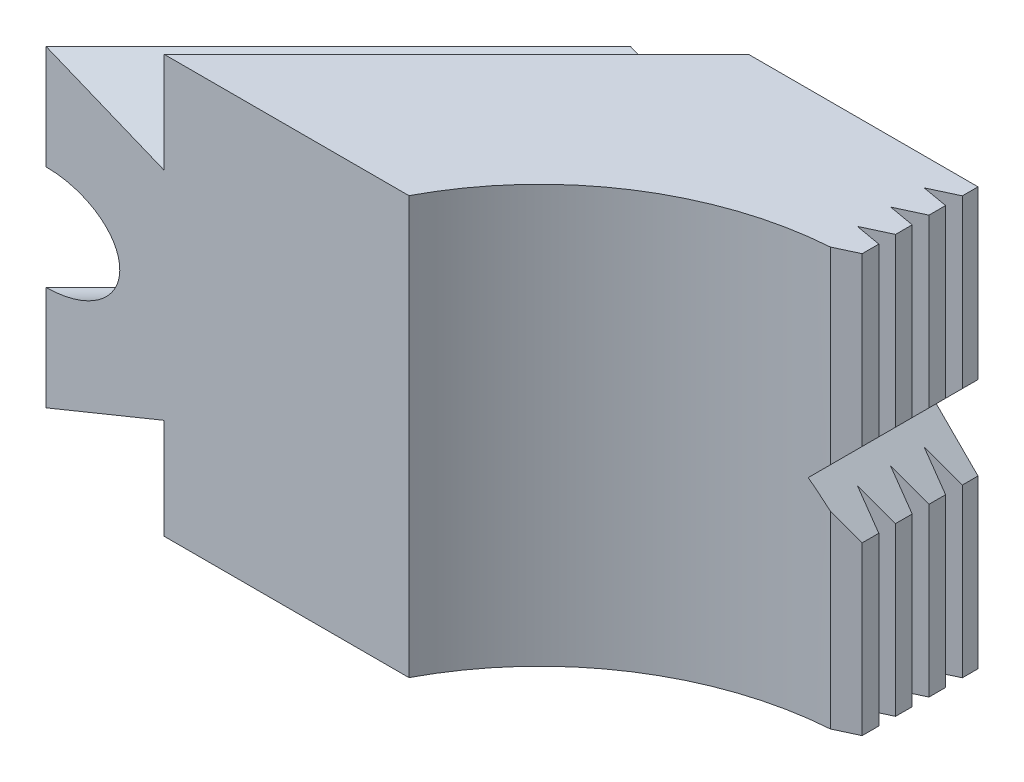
ISO-10303-21;
HEADER;
FILE_DESCRIPTION(('STEP AP214'),'2;1');
FILE_NAME('part.step','',(''),(''),'','','');
FILE_SCHEMA(('AUTOMOTIVE_DESIGN { 1 0 10303 214 1 1 1 1 }'));
ENDSEC;
DATA;
#1=APPLICATION_CONTEXT('core data for automotive mechanical design processes');
#2=APPLICATION_PROTOCOL_DEFINITION('international standard','automotive_design',2000,#1);
#3=PRODUCT_CONTEXT('',#1,'mechanical');
#4=PRODUCT('Part','Part','',(#3));
#5=PRODUCT_RELATED_PRODUCT_CATEGORY('part','',(#4));
#6=PRODUCT_DEFINITION_FORMATION('','',#4);
#7=PRODUCT_DEFINITION_CONTEXT('part definition',#1,'design');
#8=PRODUCT_DEFINITION('design','',#6,#7);
#9=PRODUCT_DEFINITION_SHAPE('','',#8);
#10=(LENGTH_UNIT() NAMED_UNIT(*) SI_UNIT(.MILLI.,.METRE.));
#11=(NAMED_UNIT(*) PLANE_ANGLE_UNIT() SI_UNIT($,.RADIAN.));
#12=(NAMED_UNIT(*) SI_UNIT($,.STERADIAN.) SOLID_ANGLE_UNIT());
#13=UNCERTAINTY_MEASURE_WITH_UNIT(LENGTH_MEASURE(1.E-05),#10,'distance_accuracy_value','');
#14=(GEOMETRIC_REPRESENTATION_CONTEXT(3) GLOBAL_UNCERTAINTY_ASSIGNED_CONTEXT((#13)) GLOBAL_UNIT_ASSIGNED_CONTEXT((#10,
#11,#12)) REPRESENTATION_CONTEXT('',''));
#15=CARTESIAN_POINT('',(0.,0.,0.));
#16=DIRECTION('',(0.,0.,1.));
#17=DIRECTION('',(1.,0.,0.));
#18=AXIS2_PLACEMENT_3D('',#15,#16,#17);
#19=CARTESIAN_POINT('',(-14.2114177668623,6.92820323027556,14.2114177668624));
#20=DIRECTION('',(0.707106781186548,0.,-0.707106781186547));
#21=DIRECTION('',(0.,1.,0.));
#22=AXIS2_PLACEMENT_3D('',#19,#20,#21);
#23=PLANE('',#22);
#24=DIRECTION('',(-0.353553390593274,-0.866025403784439,-0.353553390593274));
#25=VECTOR('',#24,1.);
#26=CARTESIAN_POINT('',(-15.6256313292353,3.4641016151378,12.7972042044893));
#27=LINE('',#26,#25);
#28=CARTESIAN_POINT('',(-15.6256313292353,3.4641016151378,12.7972042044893));
#29=VERTEX_POINT('',#28);
#30=CARTESIAN_POINT('',(-17.0398448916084,0.,11.3829906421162));
#31=VERTEX_POINT('',#30);
#32=EDGE_CURVE('E419',#29,#31,#27,.T.);
#33=ORIENTED_EDGE('',*,*,#32,.T.);
#34=DIRECTION('',(0.353553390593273,-0.866025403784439,0.353553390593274));
#35=VECTOR('',#34,1.);
#36=CARTESIAN_POINT('',(-17.0398448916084,0.,11.3829906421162));
#37=LINE('',#36,#35);
#38=CARTESIAN_POINT('',(-15.6256313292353,-3.46410161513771,12.7972042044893));
#39=VERTEX_POINT('',#38);
#40=EDGE_CURVE('E422',#31,#39,#37,.T.);
#41=ORIENTED_EDGE('',*,*,#40,.T.);
#42=DIRECTION('',(0.707106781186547,0.,0.707106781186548));
#43=VECTOR('',#42,1.);
#44=CARTESIAN_POINT('',(-15.6256313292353,-3.46410161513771,12.7972042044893));
#45=LINE('',#44,#43);
#46=CARTESIAN_POINT('',(-12.7972042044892,-3.46410161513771,15.6256313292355));
#47=VERTEX_POINT('',#46);
#48=EDGE_CURVE('E425',#39,#47,#45,.T.);
#49=ORIENTED_EDGE('',*,*,#48,.T.);
#50=DIRECTION('',(0.353553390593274,0.866025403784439,0.353553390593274));
#51=VECTOR('',#50,1.);
#52=CARTESIAN_POINT('',(-12.7972042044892,-3.46410161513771,15.6256313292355));
#53=LINE('',#52,#51);
#54=CARTESIAN_POINT('',(-11.3829906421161,0.,17.0398448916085));
#55=VERTEX_POINT('',#54);
#56=EDGE_CURVE('E428',#47,#55,#53,.T.);
#57=ORIENTED_EDGE('',*,*,#56,.T.);
#58=DIRECTION('',(-0.353553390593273,0.866025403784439,-0.353553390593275));
#59=VECTOR('',#58,1.);
#60=CARTESIAN_POINT('',(-11.3829906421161,0.,17.0398448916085));
#61=LINE('',#60,#59);
#62=CARTESIAN_POINT('',(-12.7972042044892,3.4641016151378,15.6256313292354));
#63=VERTEX_POINT('',#62);
#64=EDGE_CURVE('E431',#55,#63,#61,.T.);
#65=ORIENTED_EDGE('',*,*,#64,.T.);
#66=DIRECTION('',(-0.707106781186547,0.,-0.707106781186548));
#67=VECTOR('',#66,1.);
#68=CARTESIAN_POINT('',(-12.7972042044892,3.4641016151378,15.6256313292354));
#69=LINE('',#68,#67);
#70=EDGE_CURVE('E434',#63,#29,#69,.T.);
#71=ORIENTED_EDGE('',*,*,#70,.T.);
#72=EDGE_LOOP('',(#33,#41,#49,#57,#65,#71));
#73=FACE_BOUND('',#72,.T.);
#74=ADVANCED_FACE('F14',(#73),#23,.F.);
#75=CARTESIAN_POINT('',(-17.0398448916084,0.,11.3829906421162));
#76=DIRECTION('',(-0.612372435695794,-0.5,-0.612372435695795));
#77=DIRECTION('',(0.353553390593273,-0.866025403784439,0.353553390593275));
#78=AXIS2_PLACEMENT_3D('',#75,#76,#77);
#79=PLANE('',#78);
#80=DIRECTION('',(0.353553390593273,-0.866025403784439,0.353553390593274));
#81=VECTOR('',#80,1.);
#82=CARTESIAN_POINT('',(-22.6966991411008,0.,17.0398448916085));
#83=LINE('',#82,#81);
#84=CARTESIAN_POINT('',(-22.6966991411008,0.,17.0398448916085));
#85=VERTEX_POINT('',#84);
#86=CARTESIAN_POINT('',(-21.2824855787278,-3.4641016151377,18.4540584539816));
#87=VERTEX_POINT('',#86);
#88=EDGE_CURVE('E404',#85,#87,#83,.T.);
#89=ORIENTED_EDGE('',*,*,#88,.T.);
#90=DIRECTION('',(-0.707106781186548,0.,0.707106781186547));
#91=VECTOR('',#90,1.);
#92=CARTESIAN_POINT('',(-15.6256313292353,-3.46410161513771,12.7972042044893));
#93=LINE('',#92,#91);
#94=EDGE_CURVE('E447',#39,#87,#93,.T.);
#95=ORIENTED_EDGE('',*,*,#94,.F.);
#96=ORIENTED_EDGE('',*,*,#40,.F.);
#97=DIRECTION('',(-0.707106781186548,0.,0.707106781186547));
#98=VECTOR('',#97,1.);
#99=CARTESIAN_POINT('',(-17.0398448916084,0.,11.3829906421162));
#100=LINE('',#99,#98);
#101=EDGE_CURVE('E437',#31,#85,#100,.T.);
#102=ORIENTED_EDGE('',*,*,#101,.T.);
#103=EDGE_LOOP('',(#89,#95,#96,#102));
#104=FACE_BOUND('',#103,.T.);
#105=ADVANCED_FACE('F475',(#104),#79,.F.);
#106=CARTESIAN_POINT('',(-15.6256313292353,-3.46410161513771,12.7972042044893));
#107=DIRECTION('',(0.,-1.,0.));
#108=DIRECTION('',(0.707106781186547,0.,0.707106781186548));
#109=AXIS2_PLACEMENT_3D('',#106,#107,#108);
#110=PLANE('',#109);
#111=DIRECTION('',(0.707106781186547,0.,0.707106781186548));
#112=VECTOR('',#111,1.);
#113=CARTESIAN_POINT('',(-21.2824855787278,-3.4641016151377,18.4540584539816));
#114=LINE('',#113,#112);
#115=CARTESIAN_POINT('',(-18.4540584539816,-3.4641016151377,21.2824855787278));
#116=VERTEX_POINT('',#115);
#117=EDGE_CURVE('E407',#87,#116,#114,.T.);
#118=ORIENTED_EDGE('',*,*,#117,.T.);
#119=DIRECTION('',(-0.707106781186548,0.,0.707106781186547));
#120=VECTOR('',#119,1.);
#121=CARTESIAN_POINT('',(-12.7972042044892,-3.46410161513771,15.6256313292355));
#122=LINE('',#121,#120);
#123=EDGE_CURVE('E445',#47,#116,#122,.T.);
#124=ORIENTED_EDGE('',*,*,#123,.F.);
#125=ORIENTED_EDGE('',*,*,#48,.F.);
#126=ORIENTED_EDGE('',*,*,#94,.T.);
#127=EDGE_LOOP('',(#118,#124,#125,#126));
#128=FACE_BOUND('',#127,.T.);
#129=ADVANCED_FACE('F481',(#128),#110,.F.);
#130=CARTESIAN_POINT('',(-12.7972042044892,-3.46410161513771,15.6256313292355));
#131=DIRECTION('',(0.612372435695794,-0.5,0.612372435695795));
#132=DIRECTION('',(0.353553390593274,0.866025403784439,0.353553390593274));
#133=AXIS2_PLACEMENT_3D('',#130,#131,#132);
#134=PLANE('',#133);
#135=DIRECTION('',(0.353553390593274,0.866025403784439,0.353553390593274));
#136=VECTOR('',#135,1.);
#137=CARTESIAN_POINT('',(-18.4540584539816,-3.4641016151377,21.2824855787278));
#138=LINE('',#137,#136);
#139=CARTESIAN_POINT('',(-17.0398448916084,0.,22.6966991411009));
#140=VERTEX_POINT('',#139);
#141=EDGE_CURVE('E410',#116,#140,#138,.T.);
#142=ORIENTED_EDGE('',*,*,#141,.T.);
#143=DIRECTION('',(-0.707106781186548,0.,0.707106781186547));
#144=VECTOR('',#143,1.);
#145=CARTESIAN_POINT('',(-11.3829906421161,0.,17.0398448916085));
#146=LINE('',#145,#144);
#147=EDGE_CURVE('E443',#55,#140,#146,.T.);
#148=ORIENTED_EDGE('',*,*,#147,.F.);
#149=ORIENTED_EDGE('',*,*,#56,.F.);
#150=ORIENTED_EDGE('',*,*,#123,.T.);
#151=EDGE_LOOP('',(#142,#148,#149,#150));
#152=FACE_BOUND('',#151,.T.);
#153=ADVANCED_FACE('F494',(#152),#134,.F.);
#154=CARTESIAN_POINT('',(-11.3829906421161,0.,17.0398448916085));
#155=DIRECTION('',(0.612372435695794,0.5,0.612372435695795));
#156=DIRECTION('',(-0.353553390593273,0.866025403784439,-0.353553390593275));
#157=AXIS2_PLACEMENT_3D('',#154,#155,#156);
#158=PLANE('',#157);
#159=DIRECTION('',(-0.353553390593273,0.866025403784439,-0.353553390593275));
#160=VECTOR('',#159,1.);
#161=CARTESIAN_POINT('',(-17.0398448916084,0.,22.6966991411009));
#162=LINE('',#161,#160);
#163=CARTESIAN_POINT('',(-18.4540584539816,3.46410161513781,21.2824855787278));
#164=VERTEX_POINT('',#163);
#165=EDGE_CURVE('E413',#140,#164,#162,.T.);
#166=ORIENTED_EDGE('',*,*,#165,.T.);
#167=DIRECTION('',(-0.707106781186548,0.,0.707106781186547));
#168=VECTOR('',#167,1.);
#169=CARTESIAN_POINT('',(-12.7972042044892,3.4641016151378,15.6256313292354));
#170=LINE('',#169,#168);
#171=EDGE_CURVE('E441',#63,#164,#170,.T.);
#172=ORIENTED_EDGE('',*,*,#171,.F.);
#173=ORIENTED_EDGE('',*,*,#64,.F.);
#174=ORIENTED_EDGE('',*,*,#147,.T.);
#175=EDGE_LOOP('',(#166,#172,#173,#174));
#176=FACE_BOUND('',#175,.T.);
#177=ADVANCED_FACE('F490',(#176),#158,.F.);
#178=CARTESIAN_POINT('',(-12.7972042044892,3.4641016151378,15.6256313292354));
#179=DIRECTION('',(0.,1.,0.));
#180=DIRECTION('',(-0.707106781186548,0.,0.707106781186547));
#181=AXIS2_PLACEMENT_3D('',#178,#179,#180);
#182=PLANE('',#181);
#183=DIRECTION('',(-0.707106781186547,0.,-0.707106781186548));
#184=VECTOR('',#183,1.);
#185=CARTESIAN_POINT('',(-18.4540584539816,3.46410161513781,21.2824855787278));
#186=LINE('',#185,#184);
#187=CARTESIAN_POINT('',(-21.2824855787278,3.46410161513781,18.4540584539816));
#188=VERTEX_POINT('',#187);
#189=EDGE_CURVE('E416',#164,#188,#186,.T.);
#190=ORIENTED_EDGE('',*,*,#189,.T.);
#191=DIRECTION('',(-0.707106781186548,0.,0.707106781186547));
#192=VECTOR('',#191,1.);
#193=CARTESIAN_POINT('',(-15.6256313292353,3.4641016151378,12.7972042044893));
#194=LINE('',#193,#192);
#195=EDGE_CURVE('E438',#29,#188,#194,.T.);
#196=ORIENTED_EDGE('',*,*,#195,.F.);
#197=ORIENTED_EDGE('',*,*,#70,.F.);
#198=ORIENTED_EDGE('',*,*,#171,.T.);
#199=EDGE_LOOP('',(#190,#196,#197,#198));
#200=FACE_BOUND('',#199,.T.);
#201=ADVANCED_FACE('F471',(#200),#182,.F.);
#202=CARTESIAN_POINT('',(-15.6256313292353,3.4641016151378,12.7972042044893));
#203=DIRECTION('',(-0.612372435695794,0.5,-0.612372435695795));
#204=DIRECTION('',(-0.353553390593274,-0.866025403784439,-0.353553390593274));
#205=AXIS2_PLACEMENT_3D('',#202,#203,#204);
#206=PLANE('',#205);
#207=DIRECTION('',(-0.353553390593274,-0.866025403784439,-0.353553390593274));
#208=VECTOR('',#207,1.);
#209=CARTESIAN_POINT('',(-21.2824855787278,3.46410161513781,18.4540584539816));
#210=LINE('',#209,#208);
#211=EDGE_CURVE('E402',#188,#85,#210,.T.);
#212=ORIENTED_EDGE('',*,*,#211,.T.);
#213=ORIENTED_EDGE('',*,*,#101,.F.);
#214=ORIENTED_EDGE('',*,*,#32,.F.);
#215=ORIENTED_EDGE('',*,*,#195,.T.);
#216=EDGE_LOOP('',(#212,#213,#214,#215));
#217=FACE_BOUND('',#216,.T.);
#218=ADVANCED_FACE('F464',(#217),#206,.F.);
#219=CARTESIAN_POINT('',(-5.72613639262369,0.,5.72613639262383));
#220=DIRECTION('',(-0.707106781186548,0.,0.707106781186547));
#221=DIRECTION('',(0.,-1.,0.));
#222=AXIS2_PLACEMENT_3D('',#219,#220,#221);
#223=PLANE('',#222);
#224=CARTESIAN_POINT('',(-5.72613639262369,0.,5.72613639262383));
#225=DIRECTION('',(-0.707106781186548,0.,0.707106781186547));
#226=DIRECTION('',(0.,-1.,0.));
#227=AXIS2_PLACEMENT_3D('',#224,#225,#226);
#228=CIRCLE('',#227,9.);
#229=CARTESIAN_POINT('',(-5.72613639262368,9.,5.72613639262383));
#230=VERTEX_POINT('',#229);
#231=CARTESIAN_POINT('',(-5.7261363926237,-9.,5.72613639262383));
#232=VERTEX_POINT('',#231);
#233=EDGE_CURVE('E440',#230,#232,#228,.T.);
#234=ORIENTED_EDGE('',*,*,#233,.F.);
#235=DIRECTION('',(0.,-1.,0.));
#236=VECTOR('',#235,1.);
#237=CARTESIAN_POINT('',(-5.72613639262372,-20.,5.72613639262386));
#238=LINE('',#237,#236);
#239=EDGE_CURVE('E377',#230,#232,#238,.T.);
#240=ORIENTED_EDGE('',*,*,#239,.T.);
#241=EDGE_LOOP('',(#234,#240));
#242=FACE_BOUND('',#241,.T.);
#243=ADVANCED_FACE('F462',(#242),#223,.F.);
#244=CARTESIAN_POINT('',(-19.8682720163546,0.,19.8682720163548));
#245=DIRECTION('',(-0.707106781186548,0.,0.707106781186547));
#246=DIRECTION('',(0.,-1.,0.));
#247=AXIS2_PLACEMENT_3D('',#244,#245,#246);
#248=PLANE('',#247);
#249=DIRECTION('',(0.,-1.,0.));
#250=VECTOR('',#249,1.);
#251=CARTESIAN_POINT('',(-19.8682720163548,-20.,19.8682720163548));
#252=LINE('',#251,#250);
#253=CARTESIAN_POINT('',(-19.8682720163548,-5.,19.8682720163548));
#254=VERTEX_POINT('',#253);
#255=CARTESIAN_POINT('',(-19.8682720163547,-9.,19.8682720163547));
#256=VERTEX_POINT('',#255);
#257=EDGE_CURVE('E31',#254,#256,#252,.T.);
#258=ORIENTED_EDGE('',*,*,#257,.F.);
#259=CARTESIAN_POINT('',(-19.8682720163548,0.,19.8682720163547));
#260=DIRECTION('',(-0.707106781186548,0.,0.707106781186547));
#261=DIRECTION('',(0.707106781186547,0.,0.707106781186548));
#262=AXIS2_PLACEMENT_3D('',#259,#260,#261);
#263=CIRCLE('',#262,5.);
#264=CARTESIAN_POINT('',(-19.8682720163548,5.,19.8682720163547));
#265=VERTEX_POINT('',#264);
#266=EDGE_CURVE('E351',#254,#265,#263,.T.);
#267=ORIENTED_EDGE('',*,*,#266,.T.);
#268=CARTESIAN_POINT('',(-19.8682720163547,9.,19.8682720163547));
#269=VERTEX_POINT('',#268);
#270=EDGE_CURVE('E39',#269,#265,#252,.T.);
#271=ORIENTED_EDGE('',*,*,#270,.F.);
#272=CARTESIAN_POINT('',(-19.8682720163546,0.,19.8682720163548));
#273=DIRECTION('',(-0.707106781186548,0.,0.707106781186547));
#274=DIRECTION('',(0.,-1.,0.));
#275=AXIS2_PLACEMENT_3D('',#272,#273,#274);
#276=CIRCLE('',#275,9.);
#277=EDGE_CURVE('E18',#269,#256,#276,.T.);
#278=ORIENTED_EDGE('',*,*,#277,.T.);
#279=EDGE_LOOP('',(#258,#267,#271,#278));
#280=FACE_BOUND('',#279,.T.);
#281=ORIENTED_EDGE('',*,*,#211,.F.);
#282=ORIENTED_EDGE('',*,*,#189,.F.);
#283=ORIENTED_EDGE('',*,*,#165,.F.);
#284=ORIENTED_EDGE('',*,*,#141,.F.);
#285=ORIENTED_EDGE('',*,*,#117,.F.);
#286=ORIENTED_EDGE('',*,*,#88,.F.);
#287=EDGE_LOOP('',(#281,#282,#283,#284,#285,#286));
#288=FACE_BOUND('',#287,.T.);
#289=ADVANCED_FACE('F455',(#280,#288),#248,.T.);
#290=CARTESIAN_POINT('',(-19.8682720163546,0.,19.8682720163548));
#291=DIRECTION('',(0.707106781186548,0.,-0.707106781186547));
#292=DIRECTION('',(0.,1.,0.));
#293=AXIS2_PLACEMENT_3D('',#290,#291,#292);
#294=CYLINDRICAL_SURFACE('',#293,9.);
#295=DIRECTION('',(-0.707106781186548,0.,0.707106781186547));
#296=VECTOR('',#295,1.);
#297=CARTESIAN_POINT('',(-5.72613639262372,-9.,5.72613639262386));
#298=LINE('',#297,#296);
#299=EDGE_CURVE('E9',#256,#232,#298,.F.);
#300=ORIENTED_EDGE('',*,*,#299,.F.);
#301=ORIENTED_EDGE('',*,*,#277,.F.);
#302=DIRECTION('',(-0.707106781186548,0.,0.707106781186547));
#303=VECTOR('',#302,1.);
#304=CARTESIAN_POINT('',(-5.72613639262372,9.,5.72613639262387));
#305=LINE('',#304,#303);
#306=EDGE_CURVE('E23',#230,#269,#305,.T.);
#307=ORIENTED_EDGE('',*,*,#306,.F.);
#308=ORIENTED_EDGE('',*,*,#233,.T.);
#309=EDGE_LOOP('',(#300,#301,#307,#308));
#310=FACE_BOUND('',#309,.T.);
#311=ADVANCED_FACE('F16',(#310),#294,.T.);
#312=CARTESIAN_POINT('',(33.3137084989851,-20.,1.49999999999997));
#313=DIRECTION('',(-0.422618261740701,0.,-0.906307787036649));
#314=DIRECTION('',(-0.906307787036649,0.,0.422618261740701));
#315=AXIS2_PLACEMENT_3D('',#312,#313,#314);
#316=PLANE('',#315);
#317=DIRECTION('',(0.,1.,0.));
#318=VECTOR('',#317,1.);
#319=CARTESIAN_POINT('',(30.8137084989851,-20.,2.66576914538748));
#320=LINE('',#319,#318);
#321=CARTESIAN_POINT('',(30.8137084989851,1.49999999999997,2.66576914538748));
#322=VERTEX_POINT('',#321);
#323=CARTESIAN_POINT('',(30.8137084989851,20.,2.66576914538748));
#324=VERTEX_POINT('',#323);
#325=EDGE_CURVE('E939',#322,#324,#320,.T.);
#326=ORIENTED_EDGE('',*,*,#325,.F.);
#327=DIRECTION('',(0.671542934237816,0.671542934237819,-0.313145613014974));
#328=VECTOR('',#327,1.);
#329=CARTESIAN_POINT('',(22.490430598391,-6.82327790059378,6.5469773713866));
#330=LINE('',#329,#328);
#331=CARTESIAN_POINT('',(33.3137084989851,4.,1.49999999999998));
#332=VERTEX_POINT('',#331);
#333=EDGE_CURVE('E1033',#322,#332,#330,.T.);
#334=ORIENTED_EDGE('',*,*,#333,.T.);
#335=DIRECTION('',(0.,1.,0.));
#336=VECTOR('',#335,1.);
#337=CARTESIAN_POINT('',(33.3137084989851,-20.,1.49999999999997));
#338=LINE('',#337,#336);
#339=CARTESIAN_POINT('',(33.3137084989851,20.,1.49999999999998));
#340=VERTEX_POINT('',#339);
#341=EDGE_CURVE('E940',#332,#340,#338,.T.);
#342=ORIENTED_EDGE('',*,*,#341,.T.);
#343=DIRECTION('',(-0.906307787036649,0.,0.422618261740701));
#344=VECTOR('',#343,1.);
#345=CARTESIAN_POINT('',(33.3137084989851,20.,1.49999999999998));
#346=LINE('',#345,#344);
#347=EDGE_CURVE('E920',#340,#324,#346,.T.);
#348=ORIENTED_EDGE('',*,*,#347,.T.);
#349=EDGE_LOOP('',(#326,#334,#342,#348));
#350=FACE_BOUND('',#349,.T.);
#351=ADVANCED_FACE('F563',(#350),#316,.F.);
#352=CARTESIAN_POINT('',(30.8137084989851,-20.,2.66576914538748));
#353=DIRECTION('',(-0.173648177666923,0.,0.984807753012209));
#354=DIRECTION('',(0.984807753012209,0.,0.173648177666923));
#355=AXIS2_PLACEMENT_3D('',#352,#353,#354);
#356=PLANE('',#355);
#357=DIRECTION('',(0.,1.,0.));
#358=VECTOR('',#357,1.);
#359=CARTESIAN_POINT('',(33.3137084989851,-20.,3.10658659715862));
#360=LINE('',#359,#358);
#361=CARTESIAN_POINT('',(33.3137084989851,4.,3.10658659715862));
#362=VERTEX_POINT('',#361);
#363=CARTESIAN_POINT('',(33.3137084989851,20.,3.10658659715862));
#364=VERTEX_POINT('',#363);
#365=EDGE_CURVE('E934',#362,#364,#360,.T.);
#366=ORIENTED_EDGE('',*,*,#365,.F.);
#367=DIRECTION('',(-0.701673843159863,-0.701673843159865,-0.123724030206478));
#368=VECTOR('',#367,1.);
#369=CARTESIAN_POINT('',(20.228265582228,-9.08544291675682,0.799269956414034));
#370=LINE('',#369,#368);
#371=EDGE_CURVE('E1030',#362,#322,#370,.T.);
#372=ORIENTED_EDGE('',*,*,#371,.T.);
#373=ORIENTED_EDGE('',*,*,#325,.T.);
#374=DIRECTION('',(0.984807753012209,0.,0.173648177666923));
#375=VECTOR('',#374,1.);
#376=CARTESIAN_POINT('',(30.8137084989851,20.,2.66576914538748));
#377=LINE('',#376,#375);
#378=EDGE_CURVE('E950',#324,#364,#377,.T.);
#379=ORIENTED_EDGE('',*,*,#378,.T.);
#380=EDGE_LOOP('',(#366,#372,#373,#379));
#381=FACE_BOUND('',#380,.T.);
#382=ADVANCED_FACE('F572',(#381),#356,.F.);
#383=CARTESIAN_POINT('',(33.3137084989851,-20.,12.));
#384=DIRECTION('',(-1.,0.,0.));
#385=DIRECTION('',(0.,-1.,0.));
#386=AXIS2_PLACEMENT_3D('',#383,#384,#385);
#387=PLANE('',#386);
#388=DIRECTION('',(0.,1.,0.));
#389=VECTOR('',#388,1.);
#390=CARTESIAN_POINT('',(33.3137084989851,-20.,4.7));
#391=LINE('',#390,#389);
#392=CARTESIAN_POINT('',(33.3137084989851,4.,4.7));
#393=VERTEX_POINT('',#392);
#394=CARTESIAN_POINT('',(33.3137084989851,20.,4.7));
#395=VERTEX_POINT('',#394);
#396=EDGE_CURVE('E959',#393,#395,#391,.T.);
#397=ORIENTED_EDGE('',*,*,#396,.F.);
#398=DIRECTION('',(0.,0.,1.));
#399=VECTOR('',#398,1.);
#400=CARTESIAN_POINT('',(33.3137084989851,4.,0.));
#401=LINE('',#400,#399);
#402=EDGE_CURVE('E1053',#362,#393,#401,.T.);
#403=ORIENTED_EDGE('',*,*,#402,.F.);
#404=ORIENTED_EDGE('',*,*,#365,.T.);
#405=DIRECTION('',(0.,0.,1.));
#406=VECTOR('',#405,1.);
#407=CARTESIAN_POINT('',(33.3137084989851,20.,12.));
#408=LINE('',#407,#406);
#409=EDGE_CURVE('E921',#364,#395,#408,.T.);
#410=ORIENTED_EDGE('',*,*,#409,.T.);
#411=EDGE_LOOP('',(#397,#403,#404,#410));
#412=FACE_BOUND('',#411,.T.);
#413=ADVANCED_FACE('F584',(#412),#387,.F.);
#414=CARTESIAN_POINT('',(33.3137084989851,-20.,4.7));
#415=DIRECTION('',(-0.422618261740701,0.,-0.906307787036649));
#416=DIRECTION('',(-0.906307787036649,0.,0.422618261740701));
#417=AXIS2_PLACEMENT_3D('',#414,#415,#416);
#418=PLANE('',#417);
#419=DIRECTION('',(0.,1.,0.));
#420=VECTOR('',#419,1.);
#421=CARTESIAN_POINT('',(30.8137084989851,-20.,5.86576914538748));
#422=LINE('',#421,#420);
#423=CARTESIAN_POINT('',(30.8137084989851,1.49999999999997,5.86576914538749));
#424=VERTEX_POINT('',#423);
#425=CARTESIAN_POINT('',(30.8137084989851,20.,5.86576914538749));
#426=VERTEX_POINT('',#425);
#427=EDGE_CURVE('E958',#424,#426,#422,.T.);
#428=ORIENTED_EDGE('',*,*,#427,.F.);
#429=DIRECTION('',(0.671542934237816,0.671542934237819,-0.313145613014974));
#430=VECTOR('',#429,1.);
#431=CARTESIAN_POINT('',(22.490430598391,-6.82327790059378,9.7469773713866));
#432=LINE('',#431,#430);
#433=EDGE_CURVE('E1039',#424,#393,#432,.T.);
#434=ORIENTED_EDGE('',*,*,#433,.T.);
#435=ORIENTED_EDGE('',*,*,#396,.T.);
#436=DIRECTION('',(-0.906307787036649,0.,0.422618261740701));
#437=VECTOR('',#436,1.);
#438=CARTESIAN_POINT('',(33.3137084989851,20.,4.7));
#439=LINE('',#438,#437);
#440=EDGE_CURVE('E975',#395,#426,#439,.T.);
#441=ORIENTED_EDGE('',*,*,#440,.T.);
#442=EDGE_LOOP('',(#428,#434,#435,#441));
#443=FACE_BOUND('',#442,.T.);
#444=ADVANCED_FACE('F596',(#443),#418,.F.);
#445=CARTESIAN_POINT('',(30.8137084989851,-20.,5.86576914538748));
#446=DIRECTION('',(-0.173648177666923,0.,0.984807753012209));
#447=DIRECTION('',(0.984807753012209,0.,0.173648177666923));
#448=AXIS2_PLACEMENT_3D('',#445,#446,#447);
#449=PLANE('',#448);
#450=DIRECTION('',(0.,1.,0.));
#451=VECTOR('',#450,1.);
#452=CARTESIAN_POINT('',(33.3137084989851,-20.,6.30658659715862));
#453=LINE('',#452,#451);
#454=CARTESIAN_POINT('',(33.3137084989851,4.,6.30658659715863));
#455=VERTEX_POINT('',#454);
#456=CARTESIAN_POINT('',(33.3137084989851,20.,6.30658659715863));
#457=VERTEX_POINT('',#456);
#458=EDGE_CURVE('E963',#455,#457,#453,.T.);
#459=ORIENTED_EDGE('',*,*,#458,.F.);
#460=DIRECTION('',(-0.701673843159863,-0.701673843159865,-0.123724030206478));
#461=VECTOR('',#460,1.);
#462=CARTESIAN_POINT('',(20.228265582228,-9.08544291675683,3.99926995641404));
#463=LINE('',#462,#461);
#464=EDGE_CURVE('E1036',#455,#424,#463,.T.);
#465=ORIENTED_EDGE('',*,*,#464,.T.);
#466=ORIENTED_EDGE('',*,*,#427,.T.);
#467=DIRECTION('',(0.984807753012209,0.,0.173648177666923));
#468=VECTOR('',#467,1.);
#469=CARTESIAN_POINT('',(30.8137084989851,20.,5.86576914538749));
#470=LINE('',#469,#468);
#471=EDGE_CURVE('E972',#426,#457,#470,.T.);
#472=ORIENTED_EDGE('',*,*,#471,.T.);
#473=EDGE_LOOP('',(#459,#465,#466,#472));
#474=FACE_BOUND('',#473,.T.);
#475=ADVANCED_FACE('F576',(#474),#449,.F.);
#476=DIRECTION('',(0.,1.,0.));
#477=VECTOR('',#476,1.);
#478=CARTESIAN_POINT('',(33.3137084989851,-20.,7.9));
#479=LINE('',#478,#477);
#480=CARTESIAN_POINT('',(33.3137084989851,4.,7.9));
#481=VERTEX_POINT('',#480);
#482=CARTESIAN_POINT('',(33.3137084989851,20.,7.9));
#483=VERTEX_POINT('',#482);
#484=EDGE_CURVE('E983',#481,#483,#479,.T.);
#485=ORIENTED_EDGE('',*,*,#484,.F.);
#486=EDGE_CURVE('E1074',#455,#481,#401,.T.);
#487=ORIENTED_EDGE('',*,*,#486,.F.);
#488=ORIENTED_EDGE('',*,*,#458,.T.);
#489=EDGE_CURVE('E926',#457,#483,#408,.T.);
#490=ORIENTED_EDGE('',*,*,#489,.T.);
#491=EDGE_LOOP('',(#485,#487,#488,#490));
#492=FACE_BOUND('',#491,.T.);
#493=ADVANCED_FACE('F599',(#492),#387,.F.);
#494=CARTESIAN_POINT('',(33.3137084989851,-20.,7.9));
#495=DIRECTION('',(-0.422618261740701,0.,-0.906307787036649));
#496=DIRECTION('',(-0.906307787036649,0.,0.422618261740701));
#497=AXIS2_PLACEMENT_3D('',#494,#495,#496);
#498=PLANE('',#497);
#499=DIRECTION('',(0.,1.,0.));
#500=VECTOR('',#499,1.);
#501=CARTESIAN_POINT('',(30.8137084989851,-20.,9.06576914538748));
#502=LINE('',#501,#500);
#503=CARTESIAN_POINT('',(30.8137084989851,1.49999999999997,9.06576914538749));
#504=VERTEX_POINT('',#503);
#505=CARTESIAN_POINT('',(30.8137084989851,20.,9.06576914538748));
#506=VERTEX_POINT('',#505);
#507=EDGE_CURVE('E982',#504,#506,#502,.T.);
#508=ORIENTED_EDGE('',*,*,#507,.F.);
#509=DIRECTION('',(0.671542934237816,0.671542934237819,-0.313145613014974));
#510=VECTOR('',#509,1.);
#511=CARTESIAN_POINT('',(22.490430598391,-6.82327790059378,12.9469773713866));
#512=LINE('',#511,#510);
#513=EDGE_CURVE('E1045',#504,#481,#512,.T.);
#514=ORIENTED_EDGE('',*,*,#513,.T.);
#515=ORIENTED_EDGE('',*,*,#484,.T.);
#516=DIRECTION('',(-0.906307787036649,0.,0.422618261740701));
#517=VECTOR('',#516,1.);
#518=CARTESIAN_POINT('',(33.3137084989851,20.,7.9));
#519=LINE('',#518,#517);
#520=EDGE_CURVE('E999',#483,#506,#519,.T.);
#521=ORIENTED_EDGE('',*,*,#520,.T.);
#522=EDGE_LOOP('',(#508,#514,#515,#521));
#523=FACE_BOUND('',#522,.T.);
#524=ADVANCED_FACE('F628',(#523),#498,.F.);
#525=CARTESIAN_POINT('',(30.8137084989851,-20.,9.06576914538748));
#526=DIRECTION('',(-0.173648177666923,0.,0.984807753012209));
#527=DIRECTION('',(0.984807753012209,0.,0.173648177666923));
#528=AXIS2_PLACEMENT_3D('',#525,#526,#527);
#529=PLANE('',#528);
#530=DIRECTION('',(0.,1.,0.));
#531=VECTOR('',#530,1.);
#532=CARTESIAN_POINT('',(33.3137084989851,-20.,9.50658659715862));
#533=LINE('',#532,#531);
#534=CARTESIAN_POINT('',(33.3137084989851,4.,9.50658659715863));
#535=VERTEX_POINT('',#534);
#536=CARTESIAN_POINT('',(33.3137084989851,20.,9.50658659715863));
#537=VERTEX_POINT('',#536);
#538=EDGE_CURVE('E987',#535,#537,#533,.T.);
#539=ORIENTED_EDGE('',*,*,#538,.F.);
#540=DIRECTION('',(-0.701673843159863,-0.701673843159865,-0.123724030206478));
#541=VECTOR('',#540,1.);
#542=CARTESIAN_POINT('',(20.228265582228,-9.08544291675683,7.19926995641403));
#543=LINE('',#542,#541);
#544=EDGE_CURVE('E1042',#535,#504,#543,.T.);
#545=ORIENTED_EDGE('',*,*,#544,.T.);
#546=ORIENTED_EDGE('',*,*,#507,.T.);
#547=DIRECTION('',(0.984807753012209,0.,0.173648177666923));
#548=VECTOR('',#547,1.);
#549=CARTESIAN_POINT('',(30.8137084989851,20.,9.06576914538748));
#550=LINE('',#549,#548);
#551=EDGE_CURVE('E996',#506,#537,#550,.T.);
#552=ORIENTED_EDGE('',*,*,#551,.T.);
#553=EDGE_LOOP('',(#539,#545,#546,#552));
#554=FACE_BOUND('',#553,.T.);
#555=ADVANCED_FACE('F610',(#554),#529,.F.);
#556=DIRECTION('',(0.,1.,0.));
#557=VECTOR('',#556,1.);
#558=CARTESIAN_POINT('',(33.3137084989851,-20.,11.1));
#559=LINE('',#558,#557);
#560=CARTESIAN_POINT('',(33.3137084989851,4.,11.1));
#561=VERTEX_POINT('',#560);
#562=CARTESIAN_POINT('',(33.3137084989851,20.,11.1));
#563=VERTEX_POINT('',#562);
#564=EDGE_CURVE('E1005',#561,#563,#559,.T.);
#565=ORIENTED_EDGE('',*,*,#564,.F.);
#566=EDGE_CURVE('E297',#535,#561,#401,.T.);
#567=ORIENTED_EDGE('',*,*,#566,.F.);
#568=ORIENTED_EDGE('',*,*,#538,.T.);
#569=EDGE_CURVE('E923',#537,#563,#408,.T.);
#570=ORIENTED_EDGE('',*,*,#569,.T.);
#571=EDGE_LOOP('',(#565,#567,#568,#570));
#572=FACE_BOUND('',#571,.T.);
#573=ADVANCED_FACE('F630',(#572),#387,.F.);
#574=CARTESIAN_POINT('',(33.3137084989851,-20.,11.1));
#575=DIRECTION('',(-0.422618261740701,0.,-0.906307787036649));
#576=DIRECTION('',(-0.906307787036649,0.,0.422618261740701));
#577=AXIS2_PLACEMENT_3D('',#574,#575,#576);
#578=PLANE('',#577);
#579=DIRECTION('',(0.,1.,0.));
#580=VECTOR('',#579,1.);
#581=CARTESIAN_POINT('',(31.2279773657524,-20.,12.0725924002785));
#582=LINE('',#581,#580);
#583=CARTESIAN_POINT('',(31.2279773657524,1.91426886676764,12.0725924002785));
#584=VERTEX_POINT('',#583);
#585=CARTESIAN_POINT('',(31.2279773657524,20.,12.0725924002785));
#586=VERTEX_POINT('',#585);
#587=EDGE_CURVE('E392',#584,#586,#582,.T.);
#588=ORIENTED_EDGE('',*,*,#587,.F.);
#589=DIRECTION('',(0.671542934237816,0.671542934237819,-0.313145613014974));
#590=VECTOR('',#589,1.);
#591=CARTESIAN_POINT('',(22.490430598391,-6.82327790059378,16.1469773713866));
#592=LINE('',#591,#590);
#593=EDGE_CURVE('E396',#584,#561,#592,.T.);
#594=ORIENTED_EDGE('',*,*,#593,.T.);
#595=ORIENTED_EDGE('',*,*,#564,.T.);
#596=DIRECTION('',(-0.906307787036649,0.,0.422618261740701));
#597=VECTOR('',#596,1.);
#598=CARTESIAN_POINT('',(33.3137084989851,20.,11.1));
#599=LINE('',#598,#597);
#600=EDGE_CURVE('E1008',#563,#586,#599,.T.);
#601=ORIENTED_EDGE('',*,*,#600,.T.);
#602=EDGE_LOOP('',(#588,#594,#595,#601));
#603=FACE_BOUND('',#602,.T.);
#604=ADVANCED_FACE('F641',(#603),#578,.F.);
#605=CARTESIAN_POINT('',(30.8137084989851,-20.,9.06576914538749));
#606=VERTEX_POINT('',#605);
#607=CARTESIAN_POINT('',(30.8137084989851,-1.49999999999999,9.06576914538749));
#608=VERTEX_POINT('',#607);
#609=EDGE_CURVE('E984',#606,#608,#502,.T.);
#610=ORIENTED_EDGE('',*,*,#609,.T.);
#611=DIRECTION('',(0.701673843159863,-0.701673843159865,0.123724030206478));
#612=VECTOR('',#611,1.);
#613=CARTESIAN_POINT('',(39.9221128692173,-10.6084043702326,10.6718265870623));
#614=LINE('',#613,#612);
#615=CARTESIAN_POINT('',(33.3137084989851,-4.,9.50658659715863));
#616=VERTEX_POINT('',#615);
#617=EDGE_CURVE('E1021',#608,#616,#614,.T.);
#618=ORIENTED_EDGE('',*,*,#617,.T.);
#619=CARTESIAN_POINT('',(33.3137084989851,-20.,9.50658659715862));
#620=VERTEX_POINT('',#619);
#621=EDGE_CURVE('E978',#620,#616,#533,.T.);
#622=ORIENTED_EDGE('',*,*,#621,.F.);
#623=DIRECTION('',(0.984807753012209,0.,0.173648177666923));
#624=VECTOR('',#623,1.);
#625=CARTESIAN_POINT('',(30.8137084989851,-20.,9.06576914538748));
#626=LINE('',#625,#624);
#627=EDGE_CURVE('E990',#606,#620,#626,.T.);
#628=ORIENTED_EDGE('',*,*,#627,.F.);
#629=EDGE_LOOP('',(#610,#618,#622,#628));
#630=FACE_BOUND('',#629,.T.);
#631=ADVANCED_FACE('F651',(#630),#529,.F.);
#632=CARTESIAN_POINT('',(33.3137084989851,-20.,7.9));
#633=VERTEX_POINT('',#632);
#634=CARTESIAN_POINT('',(33.3137084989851,-4.,7.9));
#635=VERTEX_POINT('',#634);
#636=EDGE_CURVE('E979',#633,#635,#479,.T.);
#637=ORIENTED_EDGE('',*,*,#636,.T.);
#638=DIRECTION('',(-0.671542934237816,0.671542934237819,0.313145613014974));
#639=VECTOR('',#638,1.);
#640=CARTESIAN_POINT('',(40.5292270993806,-11.2155186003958,4.53534841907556));
#641=LINE('',#640,#639);
#642=EDGE_CURVE('E1024',#635,#608,#641,.T.);
#643=ORIENTED_EDGE('',*,*,#642,.T.);
#644=ORIENTED_EDGE('',*,*,#609,.F.);
#645=DIRECTION('',(-0.906307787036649,0.,0.422618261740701));
#646=VECTOR('',#645,1.);
#647=CARTESIAN_POINT('',(33.3137084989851,-20.,7.9));
#648=LINE('',#647,#646);
#649=EDGE_CURVE('E993',#633,#606,#648,.T.);
#650=ORIENTED_EDGE('',*,*,#649,.F.);
#651=EDGE_LOOP('',(#637,#643,#644,#650));
#652=FACE_BOUND('',#651,.T.);
#653=ADVANCED_FACE('F640',(#652),#498,.F.);
#654=CARTESIAN_POINT('',(33.3137084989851,-20.,6.30658659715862));
#655=VERTEX_POINT('',#654);
#656=CARTESIAN_POINT('',(33.3137084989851,-4.,6.30658659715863));
#657=VERTEX_POINT('',#656);
#658=EDGE_CURVE('E954',#655,#657,#453,.T.);
#659=ORIENTED_EDGE('',*,*,#658,.T.);
#660=DIRECTION('',(0.,0.,1.));
#661=VECTOR('',#660,1.);
#662=CARTESIAN_POINT('',(33.3137084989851,-4.,0.));
#663=LINE('',#662,#661);
#664=EDGE_CURVE('E1056',#657,#635,#663,.T.);
#665=ORIENTED_EDGE('',*,*,#664,.T.);
#666=ORIENTED_EDGE('',*,*,#636,.F.);
#667=DIRECTION('',(0.,0.,1.));
#668=VECTOR('',#667,1.);
#669=CARTESIAN_POINT('',(33.3137084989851,-20.,12.));
#670=LINE('',#669,#668);
#671=EDGE_CURVE('E1069',#655,#633,#670,.T.);
#672=ORIENTED_EDGE('',*,*,#671,.F.);
#673=EDGE_LOOP('',(#659,#665,#666,#672));
#674=FACE_BOUND('',#673,.T.);
#675=ADVANCED_FACE('F685',(#674),#387,.F.);
#676=CARTESIAN_POINT('',(30.8137084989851,-20.,5.86576914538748));
#677=VERTEX_POINT('',#676);
#678=CARTESIAN_POINT('',(30.8137084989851,-1.49999999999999,5.86576914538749));
#679=VERTEX_POINT('',#678);
#680=EDGE_CURVE('E960',#677,#679,#422,.T.);
#681=ORIENTED_EDGE('',*,*,#680,.T.);
#682=DIRECTION('',(0.701673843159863,-0.701673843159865,0.123724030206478));
#683=VECTOR('',#682,1.);
#684=CARTESIAN_POINT('',(39.9221128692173,-10.6084043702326,7.47182658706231));
#685=LINE('',#684,#683);
#686=EDGE_CURVE('E1015',#679,#657,#685,.T.);
#687=ORIENTED_EDGE('',*,*,#686,.T.);
#688=ORIENTED_EDGE('',*,*,#658,.F.);
#689=DIRECTION('',(0.984807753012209,0.,0.173648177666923));
#690=VECTOR('',#689,1.);
#691=CARTESIAN_POINT('',(30.8137084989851,-20.,5.86576914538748));
#692=LINE('',#691,#690);
#693=EDGE_CURVE('E966',#677,#655,#692,.T.);
#694=ORIENTED_EDGE('',*,*,#693,.F.);
#695=EDGE_LOOP('',(#681,#687,#688,#694));
#696=FACE_BOUND('',#695,.T.);
#697=ADVANCED_FACE('F620',(#696),#449,.F.);
#698=CARTESIAN_POINT('',(33.3137084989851,-20.,4.7));
#699=VERTEX_POINT('',#698);
#700=CARTESIAN_POINT('',(33.3137084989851,-4.,4.7));
#701=VERTEX_POINT('',#700);
#702=EDGE_CURVE('E955',#699,#701,#391,.T.);
#703=ORIENTED_EDGE('',*,*,#702,.T.);
#704=DIRECTION('',(-0.671542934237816,0.671542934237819,0.313145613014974));
#705=VECTOR('',#704,1.);
#706=CARTESIAN_POINT('',(40.5292270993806,-11.2155186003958,1.33534841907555));
#707=LINE('',#706,#705);
#708=EDGE_CURVE('E1018',#701,#679,#707,.T.);
#709=ORIENTED_EDGE('',*,*,#708,.T.);
#710=ORIENTED_EDGE('',*,*,#680,.F.);
#711=DIRECTION('',(-0.906307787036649,0.,0.422618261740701));
#712=VECTOR('',#711,1.);
#713=CARTESIAN_POINT('',(33.3137084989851,-20.,4.7));
#714=LINE('',#713,#712);
#715=EDGE_CURVE('E969',#699,#677,#714,.T.);
#716=ORIENTED_EDGE('',*,*,#715,.F.);
#717=EDGE_LOOP('',(#703,#709,#710,#716));
#718=FACE_BOUND('',#717,.T.);
#719=ADVANCED_FACE('F609',(#718),#418,.F.);
#720=CARTESIAN_POINT('',(33.3137084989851,-20.,3.10658659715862));
#721=VERTEX_POINT('',#720);
#722=CARTESIAN_POINT('',(33.3137084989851,-4.,3.10658659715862));
#723=VERTEX_POINT('',#722);
#724=EDGE_CURVE('E932',#721,#723,#360,.T.);
#725=ORIENTED_EDGE('',*,*,#724,.T.);
#726=EDGE_CURVE('E298',#723,#701,#663,.T.);
#727=ORIENTED_EDGE('',*,*,#726,.T.);
#728=ORIENTED_EDGE('',*,*,#702,.F.);
#729=EDGE_CURVE('E1067',#721,#699,#670,.T.);
#730=ORIENTED_EDGE('',*,*,#729,.F.);
#731=EDGE_LOOP('',(#725,#727,#728,#730));
#732=FACE_BOUND('',#731,.T.);
#733=ADVANCED_FACE('F695',(#732),#387,.F.);
#734=CARTESIAN_POINT('',(30.8137084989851,-20.,2.66576914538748));
#735=VERTEX_POINT('',#734);
#736=CARTESIAN_POINT('',(30.8137084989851,-1.49999999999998,2.66576914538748));
#737=VERTEX_POINT('',#736);
#738=EDGE_CURVE('E941',#735,#737,#320,.T.);
#739=ORIENTED_EDGE('',*,*,#738,.T.);
#740=DIRECTION('',(0.701673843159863,-0.701673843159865,0.123724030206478));
#741=VECTOR('',#740,1.);
#742=CARTESIAN_POINT('',(39.9221128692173,-10.6084043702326,4.2718265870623));
#743=LINE('',#742,#741);
#744=EDGE_CURVE('E1011',#737,#723,#743,.T.);
#745=ORIENTED_EDGE('',*,*,#744,.T.);
#746=ORIENTED_EDGE('',*,*,#724,.F.);
#747=DIRECTION('',(0.984807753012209,0.,0.173648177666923));
#748=VECTOR('',#747,1.);
#749=CARTESIAN_POINT('',(30.8137084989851,-20.,2.66576914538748));
#750=LINE('',#749,#748);
#751=EDGE_CURVE('E944',#735,#721,#750,.T.);
#752=ORIENTED_EDGE('',*,*,#751,.F.);
#753=EDGE_LOOP('',(#739,#745,#746,#752));
#754=FACE_BOUND('',#753,.T.);
#755=ADVANCED_FACE('F587',(#754),#356,.F.);
#756=CARTESIAN_POINT('',(33.3137084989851,-20.,1.49999999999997));
#757=VERTEX_POINT('',#756);
#758=CARTESIAN_POINT('',(33.3137084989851,-4.,1.49999999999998));
#759=VERTEX_POINT('',#758);
#760=EDGE_CURVE('E937',#757,#759,#338,.T.);
#761=ORIENTED_EDGE('',*,*,#760,.T.);
#762=DIRECTION('',(-0.671542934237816,0.671542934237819,0.313145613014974));
#763=VECTOR('',#762,1.);
#764=CARTESIAN_POINT('',(40.5292270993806,-11.2155186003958,-1.86465158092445));
#765=LINE('',#764,#763);
#766=EDGE_CURVE('E292',#759,#737,#765,.T.);
#767=ORIENTED_EDGE('',*,*,#766,.T.);
#768=ORIENTED_EDGE('',*,*,#738,.F.);
#769=DIRECTION('',(-0.906307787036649,0.,0.422618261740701));
#770=VECTOR('',#769,1.);
#771=CARTESIAN_POINT('',(33.3137084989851,-20.,1.49999999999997));
#772=LINE('',#771,#770);
#773=EDGE_CURVE('E947',#757,#735,#772,.T.);
#774=ORIENTED_EDGE('',*,*,#773,.F.);
#775=EDGE_LOOP('',(#761,#767,#768,#774));
#776=FACE_BOUND('',#775,.T.);
#777=ADVANCED_FACE('F575',(#776),#316,.F.);
#778=CARTESIAN_POINT('',(33.3137084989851,-20.,11.1));
#779=VERTEX_POINT('',#778);
#780=CARTESIAN_POINT('',(33.3137084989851,-4.,11.1));
#781=VERTEX_POINT('',#780);
#782=EDGE_CURVE('E1002',#779,#781,#559,.T.);
#783=ORIENTED_EDGE('',*,*,#782,.T.);
#784=DIRECTION('',(-0.671542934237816,0.671542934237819,0.313145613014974));
#785=VECTOR('',#784,1.);
#786=CARTESIAN_POINT('',(40.5292270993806,-11.2155186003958,7.73534841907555));
#787=LINE('',#786,#785);
#788=CARTESIAN_POINT('',(31.2279773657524,-1.91426886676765,12.0725924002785));
#789=VERTEX_POINT('',#788);
#790=EDGE_CURVE('E399',#781,#789,#787,.T.);
#791=ORIENTED_EDGE('',*,*,#790,.T.);
#792=CARTESIAN_POINT('',(31.2279773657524,-20.,12.0725924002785));
#793=VERTEX_POINT('',#792);
#794=EDGE_CURVE('E393',#793,#789,#582,.T.);
#795=ORIENTED_EDGE('',*,*,#794,.F.);
#796=DIRECTION('',(-0.906307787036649,0.,0.422618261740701));
#797=VECTOR('',#796,1.);
#798=CARTESIAN_POINT('',(33.3137084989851,-20.,11.1));
#799=LINE('',#798,#797);
#800=EDGE_CURVE('E1006',#779,#793,#799,.T.);
#801=ORIENTED_EDGE('',*,*,#800,.F.);
#802=EDGE_LOOP('',(#783,#791,#795,#801));
#803=FACE_BOUND('',#802,.T.);
#804=ADVANCED_FACE('F660',(#803),#578,.F.);
#805=ORIENTED_EDGE('',*,*,#621,.T.);
#806=EDGE_CURVE('E300',#616,#781,#663,.T.);
#807=ORIENTED_EDGE('',*,*,#806,.T.);
#808=ORIENTED_EDGE('',*,*,#782,.F.);
#809=EDGE_CURVE('E924',#620,#779,#670,.T.);
#810=ORIENTED_EDGE('',*,*,#809,.F.);
#811=EDGE_LOOP('',(#805,#807,#808,#810));
#812=FACE_BOUND('',#811,.T.);
#813=ADVANCED_FACE('F564',(#812),#387,.F.);
#814=ORIENTED_EDGE('',*,*,#341,.F.);
#815=CARTESIAN_POINT('',(33.3137084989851,4.,0.));
#816=VERTEX_POINT('',#815);
#817=EDGE_CURVE('E916',#816,#332,#401,.T.);
#818=ORIENTED_EDGE('',*,*,#817,.F.);
#819=DIRECTION('',(0.,1.,0.));
#820=VECTOR('',#819,1.);
#821=CARTESIAN_POINT('',(33.3137084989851,-20.,0.));
#822=LINE('',#821,#820);
#823=CARTESIAN_POINT('',(33.3137084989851,20.,0.));
#824=VERTEX_POINT('',#823);
#825=EDGE_CURVE('E313',#816,#824,#822,.T.);
#826=ORIENTED_EDGE('',*,*,#825,.T.);
#827=EDGE_CURVE('E915',#824,#340,#408,.T.);
#828=ORIENTED_EDGE('',*,*,#827,.T.);
#829=EDGE_LOOP('',(#814,#818,#826,#828));
#830=FACE_BOUND('',#829,.T.);
#831=ADVANCED_FACE('F588',(#830),#387,.F.);
#832=CARTESIAN_POINT('',(33.3137084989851,-20.,0.));
#833=VERTEX_POINT('',#832);
#834=CARTESIAN_POINT('',(33.3137084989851,-4.,0.));
#835=VERTEX_POINT('',#834);
#836=EDGE_CURVE('E304',#833,#835,#822,.T.);
#837=ORIENTED_EDGE('',*,*,#836,.T.);
#838=EDGE_CURVE('E285',#835,#759,#663,.T.);
#839=ORIENTED_EDGE('',*,*,#838,.T.);
#840=ORIENTED_EDGE('',*,*,#760,.F.);
#841=EDGE_CURVE('E311',#833,#757,#670,.T.);
#842=ORIENTED_EDGE('',*,*,#841,.F.);
#843=EDGE_LOOP('',(#837,#839,#840,#842));
#844=FACE_BOUND('',#843,.T.);
#845=ADVANCED_FACE('F309',(#844),#387,.F.);
#846=CARTESIAN_POINT('',(29.313708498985,0.,0.));
#847=DIRECTION('',(-0.707106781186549,-0.707106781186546,0.));
#848=DIRECTION('',(0.707106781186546,-0.707106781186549,0.));
#849=AXIS2_PLACEMENT_3D('',#846,#847,#848);
#850=PLANE('',#849);
#851=ORIENTED_EDGE('',*,*,#766,.F.);
#852=ORIENTED_EDGE('',*,*,#838,.F.);
#853=DIRECTION('',(0.707106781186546,-0.707106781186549,0.));
#854=VECTOR('',#853,1.);
#855=CARTESIAN_POINT('',(29.313708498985,0.,0.));
#856=LINE('',#855,#854);
#857=CARTESIAN_POINT('',(29.313708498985,0.,0.));
#858=VERTEX_POINT('',#857);
#859=EDGE_CURVE('E289',#858,#835,#856,.T.);
#860=ORIENTED_EDGE('',*,*,#859,.F.);
#861=DIRECTION('',(0.,0.,1.));
#862=VECTOR('',#861,1.);
#863=CARTESIAN_POINT('',(29.313708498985,0.,0.));
#864=LINE('',#863,#862);
#865=CARTESIAN_POINT('',(29.313708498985,0.,12.267862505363));
#866=VERTEX_POINT('',#865);
#867=EDGE_CURVE('E1050',#858,#866,#864,.T.);
#868=ORIENTED_EDGE('',*,*,#867,.T.);
#869=CARTESIAN_POINT('',(33.3137084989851,-4.,42.));
#870=DIRECTION('',(-0.707106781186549,-0.707106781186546,0.));
#871=DIRECTION('',(-0.707106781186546,0.707106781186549,0.));
#872=AXIS2_PLACEMENT_3D('',#869,#870,#871);
#873=ELLIPSE('',#872,42.4264068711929,30.);
#874=EDGE_CURVE('E1027',#789,#866,#873,.F.);
#875=ORIENTED_EDGE('',*,*,#874,.F.);
#876=ORIENTED_EDGE('',*,*,#790,.F.);
#877=ORIENTED_EDGE('',*,*,#806,.F.);
#878=ORIENTED_EDGE('',*,*,#617,.F.);
#879=ORIENTED_EDGE('',*,*,#642,.F.);
#880=ORIENTED_EDGE('',*,*,#664,.F.);
#881=ORIENTED_EDGE('',*,*,#686,.F.);
#882=ORIENTED_EDGE('',*,*,#708,.F.);
#883=ORIENTED_EDGE('',*,*,#726,.F.);
#884=ORIENTED_EDGE('',*,*,#744,.F.);
#885=EDGE_LOOP('',(#851,#852,#860,#868,#875,#876,#877,#878,#879,#880,#881,#882,#883,#884));
#886=FACE_BOUND('',#885,.T.);
#887=ADVANCED_FACE('F287',(#886),#850,.F.);
#888=CARTESIAN_POINT('',(29.313708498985,0.,0.));
#889=DIRECTION('',(-0.707106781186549,0.707106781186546,0.));
#890=DIRECTION('',(-0.707106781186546,-0.707106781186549,0.));
#891=AXIS2_PLACEMENT_3D('',#888,#889,#890);
#892=PLANE('',#891);
#893=ORIENTED_EDGE('',*,*,#402,.T.);
#894=ORIENTED_EDGE('',*,*,#433,.F.);
#895=ORIENTED_EDGE('',*,*,#464,.F.);
#896=ORIENTED_EDGE('',*,*,#486,.T.);
#897=ORIENTED_EDGE('',*,*,#513,.F.);
#898=ORIENTED_EDGE('',*,*,#544,.F.);
#899=ORIENTED_EDGE('',*,*,#566,.T.);
#900=ORIENTED_EDGE('',*,*,#593,.F.);
#901=CARTESIAN_POINT('',(33.3137084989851,4.,42.));
#902=DIRECTION('',(-0.707106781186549,0.707106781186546,0.));
#903=DIRECTION('',(0.707106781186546,0.707106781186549,0.));
#904=AXIS2_PLACEMENT_3D('',#901,#902,#903);
#905=ELLIPSE('',#904,42.4264068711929,30.);
#906=EDGE_CURVE('E1048',#866,#584,#905,.F.);
#907=ORIENTED_EDGE('',*,*,#906,.F.);
#908=ORIENTED_EDGE('',*,*,#867,.F.);
#909=DIRECTION('',(-0.707106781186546,-0.707106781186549,0.));
#910=VECTOR('',#909,1.);
#911=CARTESIAN_POINT('',(29.313708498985,0.,0.));
#912=LINE('',#911,#910);
#913=EDGE_CURVE('E307',#816,#858,#912,.T.);
#914=ORIENTED_EDGE('',*,*,#913,.F.);
#915=ORIENTED_EDGE('',*,*,#817,.T.);
#916=ORIENTED_EDGE('',*,*,#333,.F.);
#917=ORIENTED_EDGE('',*,*,#371,.F.);
#918=EDGE_LOOP('',(#893,#894,#895,#896,#897,#898,#899,#900,#907,#908,#914,#915,#916,#917));
#919=FACE_BOUND('',#918,.T.);
#920=ADVANCED_FACE('F775',(#919),#892,.F.);
#921=CARTESIAN_POINT('',(26.6568542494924,-10.3811978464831,-15.3431457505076));
#922=DIRECTION('',(0.707106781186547,0.,0.707106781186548));
#923=DIRECTION('',(0.707106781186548,0.,-0.707106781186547));
#924=AXIS2_PLACEMENT_3D('',#921,#922,#923);
#925=PLANE('',#924);
#926=DIRECTION('',(-0.707106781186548,0.,0.707106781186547));
#927=VECTOR('',#926,1.);
#928=CARTESIAN_POINT('',(26.6568542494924,-10.3811978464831,-15.3431457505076));
#929=LINE('',#928,#927);
#930=CARTESIAN_POINT('',(11.3137084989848,-10.3811978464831,0.));
#931=VERTEX_POINT('',#930);
#932=CARTESIAN_POINT('',(-16.6862915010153,-10.3811978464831,28.));
#933=VERTEX_POINT('',#932);
#934=EDGE_CURVE('E334',#931,#933,#929,.T.);
#935=ORIENTED_EDGE('',*,*,#934,.F.);
#936=DIRECTION('',(0.,1.,0.));
#937=VECTOR('',#936,1.);
#938=CARTESIAN_POINT('',(11.3137084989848,20.,0.));
#939=LINE('',#938,#937);
#940=CARTESIAN_POINT('',(11.3137084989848,-20.,0.));
#941=VERTEX_POINT('',#940);
#942=EDGE_CURVE('E338',#941,#931,#939,.T.);
#943=ORIENTED_EDGE('',*,*,#942,.F.);
#944=DIRECTION('',(0.707106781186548,0.,-0.707106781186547));
#945=VECTOR('',#944,1.);
#946=CARTESIAN_POINT('',(-22.3431457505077,-20.,33.6568542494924));
#947=LINE('',#946,#945);
#948=CARTESIAN_POINT('',(-16.6862915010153,-20.,28.));
#949=VERTEX_POINT('',#948);
#950=EDGE_CURVE('E375',#949,#941,#947,.T.);
#951=ORIENTED_EDGE('',*,*,#950,.F.);
#952=DIRECTION('',(0.,-1.,0.));
#953=VECTOR('',#952,1.);
#954=CARTESIAN_POINT('',(-16.6862915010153,20.,28.));
#955=LINE('',#954,#953);
#956=EDGE_CURVE('E343',#933,#949,#955,.T.);
#957=ORIENTED_EDGE('',*,*,#956,.F.);
#958=EDGE_LOOP('',(#935,#943,#951,#957));
#959=FACE_BOUND('',#958,.T.);
#960=ADVANCED_FACE('F784',(#959),#925,.F.);
#961=CARTESIAN_POINT('',(26.6568542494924,20.,-15.3431457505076));
#962=DIRECTION('',(0.707106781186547,0.,0.707106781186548));
#963=DIRECTION('',(0.707106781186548,0.,-0.707106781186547));
#964=AXIS2_PLACEMENT_3D('',#961,#962,#963);
#965=PLANE('',#964);
#966=DIRECTION('',(0.707106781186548,0.,-0.707106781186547));
#967=VECTOR('',#966,1.);
#968=CARTESIAN_POINT('',(-22.3431457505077,20.,33.6568542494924));
#969=LINE('',#968,#967);
#970=CARTESIAN_POINT('',(-16.6862915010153,20.,28.));
#971=VERTEX_POINT('',#970);
#972=CARTESIAN_POINT('',(11.3137084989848,20.,0.));
#973=VERTEX_POINT('',#972);
#974=EDGE_CURVE('E386',#971,#973,#969,.T.);
#975=ORIENTED_EDGE('',*,*,#974,.T.);
#976=DIRECTION('',(0.,1.,0.));
#977=VECTOR('',#976,1.);
#978=CARTESIAN_POINT('',(11.3137084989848,20.,0.));
#979=LINE('',#978,#977);
#980=CARTESIAN_POINT('',(11.3137084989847,10.3811978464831,0.));
#981=VERTEX_POINT('',#980);
#982=EDGE_CURVE('E324',#981,#973,#979,.T.);
#983=ORIENTED_EDGE('',*,*,#982,.F.);
#984=DIRECTION('',(-0.707106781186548,0.,0.707106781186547));
#985=VECTOR('',#984,1.);
#986=CARTESIAN_POINT('',(26.6568542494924,10.3811978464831,-15.3431457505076));
#987=LINE('',#986,#985);
#988=CARTESIAN_POINT('',(-16.6862915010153,10.3811978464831,28.));
#989=VERTEX_POINT('',#988);
#990=EDGE_CURVE('E315',#981,#989,#987,.T.);
#991=ORIENTED_EDGE('',*,*,#990,.T.);
#992=DIRECTION('',(0.,-1.,0.));
#993=VECTOR('',#992,1.);
#994=CARTESIAN_POINT('',(-16.6862915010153,20.,28.));
#995=LINE('',#994,#993);
#996=EDGE_CURVE('E328',#971,#989,#995,.T.);
#997=ORIENTED_EDGE('',*,*,#996,.F.);
#998=EDGE_LOOP('',(#975,#983,#991,#997));
#999=FACE_BOUND('',#998,.T.);
#1000=ADVANCED_FACE('F794',(#999),#965,.F.);
#1001=CARTESIAN_POINT('',(-28.,20.,28.));
#1002=DIRECTION('',(0.,1.,0.));
#1003=DIRECTION('',(-1.,0.,0.));
#1004=AXIS2_PLACEMENT_3D('',#1001,#1002,#1003);
#1005=PLANE('',#1004);
#1006=ORIENTED_EDGE('',*,*,#600,.F.);
#1007=ORIENTED_EDGE('',*,*,#569,.F.);
#1008=ORIENTED_EDGE('',*,*,#551,.F.);
#1009=ORIENTED_EDGE('',*,*,#520,.F.);
#1010=ORIENTED_EDGE('',*,*,#489,.F.);
#1011=ORIENTED_EDGE('',*,*,#471,.F.);
#1012=ORIENTED_EDGE('',*,*,#440,.F.);
#1013=ORIENTED_EDGE('',*,*,#409,.F.);
#1014=ORIENTED_EDGE('',*,*,#378,.F.);
#1015=ORIENTED_EDGE('',*,*,#347,.F.);
#1016=ORIENTED_EDGE('',*,*,#827,.F.);
#1017=DIRECTION('',(-1.,0.,0.));
#1018=VECTOR('',#1017,1.);
#1019=CARTESIAN_POINT('',(-28.,20.,0.));
#1020=LINE('',#1019,#1018);
#1021=EDGE_CURVE('E366',#824,#973,#1020,.T.);
#1022=ORIENTED_EDGE('',*,*,#1021,.T.);
#1023=ORIENTED_EDGE('',*,*,#974,.F.);
#1024=DIRECTION('',(1.,0.,0.));
#1025=VECTOR('',#1024,1.);
#1026=CARTESIAN_POINT('',(-28.,20.,28.));
#1027=LINE('',#1026,#1025);
#1028=CARTESIAN_POINT('',(6.78071017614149,20.,28.));
#1029=VERTEX_POINT('',#1028);
#1030=EDGE_CURVE('E363',#971,#1029,#1027,.T.);
#1031=ORIENTED_EDGE('',*,*,#1030,.T.);
#1032=CARTESIAN_POINT('',(33.3137084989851,20.,42.));
#1033=DIRECTION('',(0.,1.,0.));
#1034=DIRECTION('',(-1.,0.,0.));
#1035=AXIS2_PLACEMENT_3D('',#1032,#1033,#1034);
#1036=CIRCLE('',#1035,30.);
#1037=EDGE_CURVE('E908',#586,#1029,#1036,.T.);
#1038=ORIENTED_EDGE('',*,*,#1037,.F.);
#1039=EDGE_LOOP('',(#1006,#1007,#1008,#1009,#1010,#1011,#1012,#1013,#1014,#1015,#1016,#1022,
#1023,#1031,#1038));
#1040=FACE_BOUND('',#1039,.T.);
#1041=ADVANCED_FACE('F806',(#1040),#1005,.T.);
#1042=CARTESIAN_POINT('',(33.3137084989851,-20.,42.));
#1043=DIRECTION('',(0.,1.,0.));
#1044=DIRECTION('',(-1.,0.,0.));
#1045=AXIS2_PLACEMENT_3D('',#1042,#1043,#1044);
#1046=CYLINDRICAL_SURFACE('',#1045,30.);
#1047=ORIENTED_EDGE('',*,*,#794,.T.);
#1048=ORIENTED_EDGE('',*,*,#874,.T.);
#1049=ORIENTED_EDGE('',*,*,#906,.T.);
#1050=ORIENTED_EDGE('',*,*,#587,.T.);
#1051=ORIENTED_EDGE('',*,*,#1037,.T.);
#1052=DIRECTION('',(0.,1.,0.));
#1053=VECTOR('',#1052,1.);
#1054=CARTESIAN_POINT('',(6.78071017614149,-20.,28.));
#1055=LINE('',#1054,#1053);
#1056=CARTESIAN_POINT('',(6.78071017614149,-20.,28.));
#1057=VERTEX_POINT('',#1056);
#1058=EDGE_CURVE('E317',#1057,#1029,#1055,.T.);
#1059=ORIENTED_EDGE('',*,*,#1058,.F.);
#1060=CARTESIAN_POINT('',(33.3137084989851,-20.,42.));
#1061=DIRECTION('',(0.,1.,0.));
#1062=DIRECTION('',(-1.,0.,0.));
#1063=AXIS2_PLACEMENT_3D('',#1060,#1061,#1062);
#1064=CIRCLE('',#1063,30.);
#1065=EDGE_CURVE('E902',#793,#1057,#1064,.T.);
#1066=ORIENTED_EDGE('',*,*,#1065,.F.);
#1067=EDGE_LOOP('',(#1047,#1048,#1049,#1050,#1051,#1059,#1066));
#1068=FACE_BOUND('',#1067,.T.);
#1069=ADVANCED_FACE('F760',(#1068),#1046,.F.);
#1070=CARTESIAN_POINT('',(-28.,-20.,28.));
#1071=DIRECTION('',(0.,1.,0.));
#1072=DIRECTION('',(-1.,0.,0.));
#1073=AXIS2_PLACEMENT_3D('',#1070,#1071,#1072);
#1074=PLANE('',#1073);
#1075=ORIENTED_EDGE('',*,*,#809,.T.);
#1076=ORIENTED_EDGE('',*,*,#800,.T.);
#1077=ORIENTED_EDGE('',*,*,#1065,.T.);
#1078=DIRECTION('',(1.,0.,0.));
#1079=VECTOR('',#1078,1.);
#1080=CARTESIAN_POINT('',(-28.,-20.,28.));
#1081=LINE('',#1080,#1079);
#1082=EDGE_CURVE('E358',#949,#1057,#1081,.T.);
#1083=ORIENTED_EDGE('',*,*,#1082,.F.);
#1084=ORIENTED_EDGE('',*,*,#950,.T.);
#1085=DIRECTION('',(-1.,0.,0.));
#1086=VECTOR('',#1085,1.);
#1087=CARTESIAN_POINT('',(-28.,-20.,0.));
#1088=LINE('',#1087,#1086);
#1089=EDGE_CURVE('E361',#833,#941,#1088,.T.);
#1090=ORIENTED_EDGE('',*,*,#1089,.F.);
#1091=ORIENTED_EDGE('',*,*,#841,.T.);
#1092=ORIENTED_EDGE('',*,*,#773,.T.);
#1093=ORIENTED_EDGE('',*,*,#751,.T.);
#1094=ORIENTED_EDGE('',*,*,#729,.T.);
#1095=ORIENTED_EDGE('',*,*,#715,.T.);
#1096=ORIENTED_EDGE('',*,*,#693,.T.);
#1097=ORIENTED_EDGE('',*,*,#671,.T.);
#1098=ORIENTED_EDGE('',*,*,#649,.T.);
#1099=ORIENTED_EDGE('',*,*,#627,.T.);
#1100=EDGE_LOOP('',(#1075,#1076,#1077,#1083,#1084,#1090,#1091,#1092,#1093,#1094,#1095,#1096,
#1097,#1098,#1099));
#1101=FACE_BOUND('',#1100,.T.);
#1102=ADVANCED_FACE('F818',(#1101),#1074,.F.);
#1103=CARTESIAN_POINT('',(21.,-15.,-21.));
#1104=DIRECTION('',(-0.353553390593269,0.866025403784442,-0.35355339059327));
#1105=DIRECTION('',(0.,-0.377964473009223,-0.925820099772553));
#1106=AXIS2_PLACEMENT_3D('',#1103,#1104,#1105);
#1107=PLANE('',#1106);
#1108=DIRECTION('',(-0.707106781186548,0.,0.707106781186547));
#1109=VECTOR('',#1108,1.);
#1110=CARTESIAN_POINT('',(21.,-15.,-21.));
#1111=LINE('',#1110,#1109);
#1112=CARTESIAN_POINT('',(0.,-15.,0.));
#1113=VERTEX_POINT('',#1112);
#1114=CARTESIAN_POINT('',(-28.,-15.,28.));
#1115=VERTEX_POINT('',#1114);
#1116=EDGE_CURVE('E335',#1113,#1115,#1111,.T.);
#1117=ORIENTED_EDGE('',*,*,#1116,.F.);
#1118=DIRECTION('',(-0.925820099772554,-0.377964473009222,0.));
#1119=VECTOR('',#1118,1.);
#1120=CARTESIAN_POINT('',(-11.7525512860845,-19.7979589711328,0.));
#1121=LINE('',#1120,#1119);
#1122=EDGE_CURVE('E383',#931,#1113,#1121,.T.);
#1123=ORIENTED_EDGE('',*,*,#1122,.F.);
#1124=ORIENTED_EDGE('',*,*,#934,.T.);
#1125=DIRECTION('',(0.925820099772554,0.377964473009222,0.));
#1126=VECTOR('',#1125,1.);
#1127=CARTESIAN_POINT('',(-15.7525512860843,-10.0000000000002,28.));
#1128=LINE('',#1127,#1126);
#1129=EDGE_CURVE('E346',#1115,#933,#1128,.T.);
#1130=ORIENTED_EDGE('',*,*,#1129,.F.);
#1131=EDGE_LOOP('',(#1117,#1123,#1124,#1130));
#1132=FACE_BOUND('',#1131,.T.);
#1133=ADVANCED_FACE('F798',(#1132),#1107,.F.);
#1134=CARTESIAN_POINT('',(-28.,20.,0.));
#1135=DIRECTION('',(0.,0.,1.));
#1136=DIRECTION('',(1.,0.,0.));
#1137=AXIS2_PLACEMENT_3D('',#1134,#1135,#1136);
#1138=PLANE('',#1137);
#1139=ORIENTED_EDGE('',*,*,#913,.T.);
#1140=ORIENTED_EDGE('',*,*,#859,.T.);
#1141=ORIENTED_EDGE('',*,*,#836,.F.);
#1142=ORIENTED_EDGE('',*,*,#1089,.T.);
#1143=ORIENTED_EDGE('',*,*,#942,.T.);
#1144=ORIENTED_EDGE('',*,*,#1122,.T.);
#1145=DIRECTION('',(0.,1.,0.));
#1146=VECTOR('',#1145,1.);
#1147=CARTESIAN_POINT('',(2.09901540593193E-13,-20.,0.));
#1148=LINE('',#1147,#1146);
#1149=CARTESIAN_POINT('',(0.,15.,0.));
#1150=VERTEX_POINT('',#1149);
#1151=EDGE_CURVE('E355',#1113,#1150,#1148,.T.);
#1152=ORIENTED_EDGE('',*,*,#1151,.T.);
#1153=DIRECTION('',(0.925820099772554,-0.377964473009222,0.));
#1154=VECTOR('',#1153,1.);
#1155=CARTESIAN_POINT('',(-25.7496355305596,25.5122446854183,0.));
#1156=LINE('',#1155,#1154);
#1157=EDGE_CURVE('E389',#1150,#981,#1156,.T.);
#1158=ORIENTED_EDGE('',*,*,#1157,.T.);
#1159=ORIENTED_EDGE('',*,*,#982,.T.);
#1160=ORIENTED_EDGE('',*,*,#1021,.F.);
#1161=ORIENTED_EDGE('',*,*,#825,.F.);
#1162=EDGE_LOOP('',(#1139,#1140,#1141,#1142,#1143,#1144,#1152,#1158,#1159,#1160,#1161));
#1163=FACE_BOUND('',#1162,.T.);
#1164=ADVANCED_FACE('F303',(#1163),#1138,.F.);
#1165=CARTESIAN_POINT('',(21.,15.,-21.));
#1166=DIRECTION('',(-0.35355339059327,-0.866025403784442,-0.35355339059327));
#1167=DIRECTION('',(0.,-0.377964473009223,0.925820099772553));
#1168=AXIS2_PLACEMENT_3D('',#1165,#1166,#1167);
#1169=PLANE('',#1168);
#1170=ORIENTED_EDGE('',*,*,#990,.F.);
#1171=ORIENTED_EDGE('',*,*,#1157,.F.);
#1172=DIRECTION('',(-0.707106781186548,0.,0.707106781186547));
#1173=VECTOR('',#1172,1.);
#1174=CARTESIAN_POINT('',(21.,15.,-21.));
#1175=LINE('',#1174,#1173);
#1176=CARTESIAN_POINT('',(-28.,15.,28.));
#1177=VERTEX_POINT('',#1176);
#1178=EDGE_CURVE('E312',#1150,#1177,#1175,.T.);
#1179=ORIENTED_EDGE('',*,*,#1178,.T.);
#1180=DIRECTION('',(-0.925820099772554,0.377964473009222,0.));
#1181=VECTOR('',#1180,1.);
#1182=CARTESIAN_POINT('',(-29.7496355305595,15.7142857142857,28.));
#1183=LINE('',#1182,#1181);
#1184=EDGE_CURVE('E331',#989,#1177,#1183,.T.);
#1185=ORIENTED_EDGE('',*,*,#1184,.F.);
#1186=EDGE_LOOP('',(#1170,#1171,#1179,#1185));
#1187=FACE_BOUND('',#1186,.T.);
#1188=ADVANCED_FACE('F797',(#1187),#1169,.F.);
#1189=CARTESIAN_POINT('',(-28.,20.,28.));
#1190=DIRECTION('',(0.,0.,-1.));
#1191=DIRECTION('',(-1.,0.,0.));
#1192=AXIS2_PLACEMENT_3D('',#1189,#1190,#1191);
#1193=PLANE('',#1192);
#1194=ORIENTED_EDGE('',*,*,#1082,.T.);
#1195=ORIENTED_EDGE('',*,*,#1058,.T.);
#1196=ORIENTED_EDGE('',*,*,#1030,.F.);
#1197=ORIENTED_EDGE('',*,*,#996,.T.);
#1198=ORIENTED_EDGE('',*,*,#1184,.T.);
#1199=DIRECTION('',(0.,-1.,0.));
#1200=VECTOR('',#1199,1.);
#1201=CARTESIAN_POINT('',(-28.,20.,28.));
#1202=LINE('',#1201,#1200);
#1203=CARTESIAN_POINT('',(-28.,5.,28.));
#1204=VERTEX_POINT('',#1203);
#1205=EDGE_CURVE('E369',#1177,#1204,#1202,.T.);
#1206=ORIENTED_EDGE('',*,*,#1205,.T.);
#1207=CARTESIAN_POINT('',(-28.,0.,28.));
#1208=DIRECTION('',(0.,0.,-1.));
#1209=DIRECTION('',(1.,0.,0.));
#1210=AXIS2_PLACEMENT_3D('',#1207,#1208,#1209);
#1211=ELLIPSE('',#1210,7.07106781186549,5.);
#1212=CARTESIAN_POINT('',(-28.,-5.,28.));
#1213=VERTEX_POINT('',#1212);
#1214=EDGE_CURVE('E349',#1213,#1204,#1211,.F.);
#1215=ORIENTED_EDGE('',*,*,#1214,.F.);
#1216=EDGE_CURVE('E368',#1213,#1115,#1202,.T.);
#1217=ORIENTED_EDGE('',*,*,#1216,.T.);
#1218=ORIENTED_EDGE('',*,*,#1129,.T.);
#1219=ORIENTED_EDGE('',*,*,#956,.T.);
#1220=EDGE_LOOP('',(#1194,#1195,#1196,#1197,#1198,#1206,#1215,#1217,#1218,#1219));
#1221=FACE_BOUND('',#1220,.T.);
#1222=ADVANCED_FACE('F486',(#1221),#1193,.F.);
#1223=CARTESIAN_POINT('',(-28.,-20.,28.));
#1224=DIRECTION('',(0.707106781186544,0.,0.707106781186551));
#1225=DIRECTION('',(0.707106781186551,0.,-0.707106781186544));
#1226=AXIS2_PLACEMENT_3D('',#1223,#1224,#1225);
#1227=PLANE('',#1226);
#1228=ORIENTED_EDGE('',*,*,#1205,.F.);
#1229=ORIENTED_EDGE('',*,*,#1178,.F.);
#1230=ORIENTED_EDGE('',*,*,#1151,.F.);
#1231=ORIENTED_EDGE('',*,*,#1116,.T.);
#1232=ORIENTED_EDGE('',*,*,#1216,.F.);
#1233=DIRECTION('',(0.707106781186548,0.,-0.707106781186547));
#1234=VECTOR('',#1233,1.);
#1235=CARTESIAN_POINT('',(-28.,-5.,28.));
#1236=LINE('',#1235,#1234);
#1237=EDGE_CURVE('E374',#254,#1213,#1236,.F.);
#1238=ORIENTED_EDGE('',*,*,#1237,.F.);
#1239=ORIENTED_EDGE('',*,*,#257,.T.);
#1240=ORIENTED_EDGE('',*,*,#299,.T.);
#1241=ORIENTED_EDGE('',*,*,#239,.F.);
#1242=ORIENTED_EDGE('',*,*,#306,.T.);
#1243=ORIENTED_EDGE('',*,*,#270,.T.);
#1244=DIRECTION('',(0.707106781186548,0.,-0.707106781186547));
#1245=VECTOR('',#1244,1.);
#1246=CARTESIAN_POINT('',(-28.,5.,28.));
#1247=LINE('',#1246,#1245);
#1248=EDGE_CURVE('E371',#1204,#265,#1247,.T.);
#1249=ORIENTED_EDGE('',*,*,#1248,.F.);
#1250=EDGE_LOOP('',(#1228,#1229,#1230,#1231,#1232,#1238,#1239,#1240,#1241,#1242,#1243,#1249));
#1251=FACE_BOUND('',#1250,.T.);
#1252=ADVANCED_FACE('F459',(#1251),#1227,.F.);
#1253=CARTESIAN_POINT('',(-28.,0.,28.));
#1254=DIRECTION('',(0.707106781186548,0.,-0.707106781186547));
#1255=DIRECTION('',(-0.707106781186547,0.,-0.707106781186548));
#1256=AXIS2_PLACEMENT_3D('',#1253,#1254,#1255);
#1257=CYLINDRICAL_SURFACE('',#1256,5.);
#1258=ORIENTED_EDGE('',*,*,#1237,.T.);
#1259=ORIENTED_EDGE('',*,*,#1214,.T.);
#1260=ORIENTED_EDGE('',*,*,#1248,.T.);
#1261=ORIENTED_EDGE('',*,*,#266,.F.);
#1262=EDGE_LOOP('',(#1258,#1259,#1260,#1261));
#1263=FACE_BOUND('',#1262,.T.);
#1264=ADVANCED_FACE('F837',(#1263),#1257,.F.);
#1265=CLOSED_SHELL('',(#74,#105,#129,#153,#177,#201,#218,#243,#289,#311,#351,#382,#413,#444,
#475,#493,#524,#555,#573,#604,#631,#653,#675,#697,#719,#733,#755,#777,#804,#813,#831,#845,#887,
#920,#960,#1000,#1041,#1069,#1102,#1133,#1164,#1188,#1222,#1252,#1264));
#1266=MANIFOLD_SOLID_BREP('B1',#1265);
#1267=ADVANCED_BREP_SHAPE_REPRESENTATION('',(#18,#1266),#14);
#1268=SHAPE_DEFINITION_REPRESENTATION(#9,#1267);
ENDSEC;
END-ISO-10303-21;
